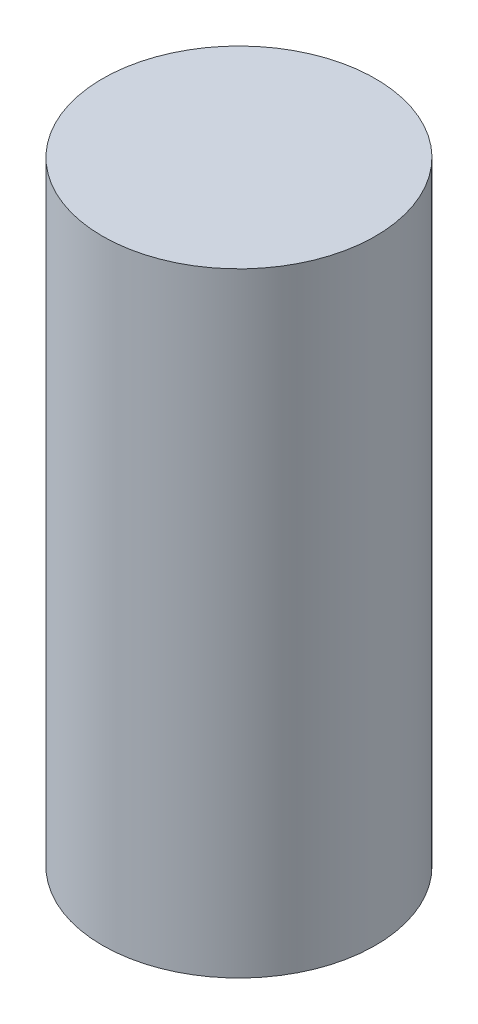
ISO-10303-21;
HEADER;
FILE_DESCRIPTION(('STEP AP214'),'2;1');
FILE_NAME('part.step','',(''),(''),'','','');
FILE_SCHEMA(('AUTOMOTIVE_DESIGN { 1 0 10303 214 1 1 1 1 }'));
ENDSEC;
DATA;
#1=APPLICATION_CONTEXT('core data for automotive mechanical design processes');
#2=APPLICATION_PROTOCOL_DEFINITION('international standard','automotive_design',2000,#1);
#3=PRODUCT_CONTEXT('',#1,'mechanical');
#4=PRODUCT('Part','Part','',(#3));
#5=PRODUCT_RELATED_PRODUCT_CATEGORY('part','',(#4));
#6=PRODUCT_DEFINITION_FORMATION('','',#4);
#7=PRODUCT_DEFINITION_CONTEXT('part definition',#1,'design');
#8=PRODUCT_DEFINITION('design','',#6,#7);
#9=PRODUCT_DEFINITION_SHAPE('','',#8);
#10=(LENGTH_UNIT() NAMED_UNIT(*) SI_UNIT(.MILLI.,.METRE.));
#11=(NAMED_UNIT(*) PLANE_ANGLE_UNIT() SI_UNIT($,.RADIAN.));
#12=(NAMED_UNIT(*) SI_UNIT($,.STERADIAN.) SOLID_ANGLE_UNIT());
#13=UNCERTAINTY_MEASURE_WITH_UNIT(LENGTH_MEASURE(1.E-05),#10,'distance_accuracy_value','');
#14=(GEOMETRIC_REPRESENTATION_CONTEXT(3) GLOBAL_UNCERTAINTY_ASSIGNED_CONTEXT((#13)) GLOBAL_UNIT_ASSIGNED_CONTEXT((#10,
#11,#12)) REPRESENTATION_CONTEXT('',''));
#15=CARTESIAN_POINT('',(0.,0.,0.));
#16=DIRECTION('',(0.,0.,1.));
#17=DIRECTION('',(1.,0.,0.));
#18=AXIS2_PLACEMENT_3D('',#15,#16,#17);
#19=CARTESIAN_POINT('',(0.,4.5,0.));
#20=DIRECTION('',(0.,-1.,0.));
#21=DIRECTION('',(0.,0.,-1.));
#22=AXIS2_PLACEMENT_3D('',#19,#20,#21);
#23=CYLINDRICAL_SURFACE('',#22,1.);
#24=CARTESIAN_POINT('',(0.,4.5,0.));
#25=DIRECTION('',(0.,1.,0.));
#26=DIRECTION('',(0.,0.,1.));
#27=AXIS2_PLACEMENT_3D('',#24,#25,#26);
#28=CIRCLE('',#27,1.);
#29=CARTESIAN_POINT('',(0.,4.5,1.));
#30=VERTEX_POINT('',#29);
#31=EDGE_CURVE('E10',#30,#30,#28,.T.);
#32=ORIENTED_EDGE('',*,*,#31,.F.);
#33=EDGE_LOOP('',(#32));
#34=FACE_BOUND('',#33,.T.);
#35=CARTESIAN_POINT('',(0.,0.,0.));
#36=DIRECTION('',(0.,1.,0.));
#37=DIRECTION('',(0.,0.,1.));
#38=AXIS2_PLACEMENT_3D('',#35,#36,#37);
#39=CIRCLE('',#38,1.);
#40=CARTESIAN_POINT('',(0.,0.,1.));
#41=VERTEX_POINT('',#40);
#42=EDGE_CURVE('E33',#41,#41,#39,.T.);
#43=ORIENTED_EDGE('',*,*,#42,.T.);
#44=EDGE_LOOP('',(#43));
#45=FACE_BOUND('',#44,.T.);
#46=ADVANCED_FACE('F30',(#34,#45),#23,.T.);
#47=CARTESIAN_POINT('',(0.,4.5,0.));
#48=DIRECTION('',(0.,1.,0.));
#49=DIRECTION('',(0.,0.,1.));
#50=AXIS2_PLACEMENT_3D('',#47,#48,#49);
#51=PLANE('',#50);
#52=ORIENTED_EDGE('',*,*,#31,.T.);
#53=EDGE_LOOP('',(#52));
#54=FACE_BOUND('',#53,.T.);
#55=ADVANCED_FACE('F45',(#54),#51,.T.);
#56=CARTESIAN_POINT('',(0.,0.,0.));
#57=DIRECTION('',(0.,1.,0.));
#58=DIRECTION('',(0.,0.,1.));
#59=AXIS2_PLACEMENT_3D('',#56,#57,#58);
#60=PLANE('',#59);
#61=ORIENTED_EDGE('',*,*,#42,.F.);
#62=EDGE_LOOP('',(#61));
#63=FACE_BOUND('',#62,.T.);
#64=ADVANCED_FACE('F43',(#63),#60,.F.);
#65=CLOSED_SHELL('',(#46,#55,#64));
#66=MANIFOLD_SOLID_BREP('B2',#65);
#67=ADVANCED_BREP_SHAPE_REPRESENTATION('',(#18,#66),#14);
#68=SHAPE_DEFINITION_REPRESENTATION(#9,#67);
ENDSEC;
END-ISO-10303-21;
